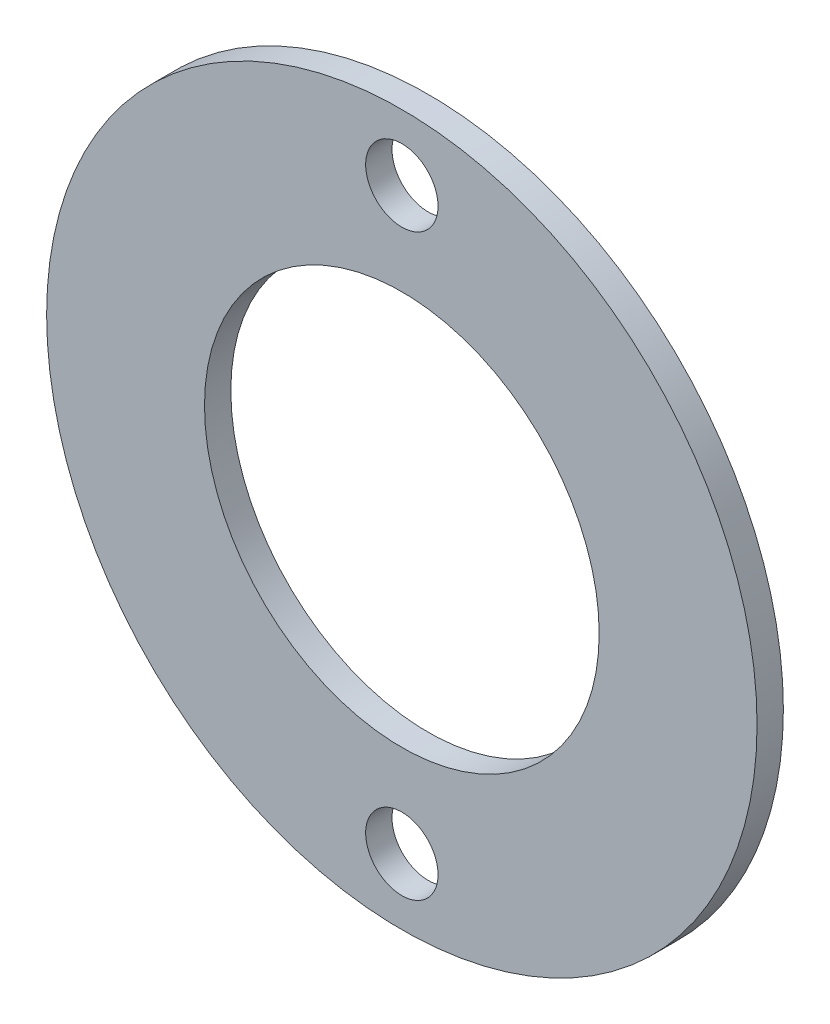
ISO-10303-21;
HEADER;
FILE_DESCRIPTION(('STEP AP214'),'2;1');
FILE_NAME('part.step','',(''),(''),'','','');
FILE_SCHEMA(('AUTOMOTIVE_DESIGN { 1 0 10303 214 1 1 1 1 }'));
ENDSEC;
DATA;
#1=APPLICATION_CONTEXT('core data for automotive mechanical design processes');
#2=APPLICATION_PROTOCOL_DEFINITION('international standard','automotive_design',2000,#1);
#3=PRODUCT_CONTEXT('',#1,'mechanical');
#4=PRODUCT('Part','Part','',(#3));
#5=PRODUCT_RELATED_PRODUCT_CATEGORY('part','',(#4));
#6=PRODUCT_DEFINITION_FORMATION('','',#4);
#7=PRODUCT_DEFINITION_CONTEXT('part definition',#1,'design');
#8=PRODUCT_DEFINITION('design','',#6,#7);
#9=PRODUCT_DEFINITION_SHAPE('','',#8);
#10=(LENGTH_UNIT() NAMED_UNIT(*) SI_UNIT(.MILLI.,.METRE.));
#11=(NAMED_UNIT(*) PLANE_ANGLE_UNIT() SI_UNIT($,.RADIAN.));
#12=(NAMED_UNIT(*) SI_UNIT($,.STERADIAN.) SOLID_ANGLE_UNIT());
#13=UNCERTAINTY_MEASURE_WITH_UNIT(LENGTH_MEASURE(1.E-05),#10,'distance_accuracy_value','');
#14=(GEOMETRIC_REPRESENTATION_CONTEXT(3) GLOBAL_UNCERTAINTY_ASSIGNED_CONTEXT((#13)) GLOBAL_UNIT_ASSIGNED_CONTEXT((#10,
#11,#12)) REPRESENTATION_CONTEXT('',''));
#15=CARTESIAN_POINT('',(0.,0.,0.));
#16=DIRECTION('',(0.,0.,1.));
#17=DIRECTION('',(1.,0.,0.));
#18=AXIS2_PLACEMENT_3D('',#15,#16,#17);
#19=CARTESIAN_POINT('',(0.,0.,1.99999999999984));
#20=DIRECTION('',(0.,0.,1.));
#21=DIRECTION('',(1.,0.,0.));
#22=AXIS2_PLACEMENT_3D('',#19,#20,#21);
#23=PLANE('',#22);
#24=CARTESIAN_POINT('',(0.,-22.,1.99999999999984));
#25=DIRECTION('',(0.,0.,1.));
#26=DIRECTION('',(1.,0.,0.));
#27=AXIS2_PLACEMENT_3D('',#24,#25,#26);
#28=CIRCLE('',#27,2.75);
#29=CARTESIAN_POINT('',(2.75000000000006,-22.,1.99999999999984));
#30=VERTEX_POINT('',#29);
#31=EDGE_CURVE('E56',#30,#30,#28,.T.);
#32=ORIENTED_EDGE('',*,*,#31,.F.);
#33=EDGE_LOOP('',(#32));
#34=FACE_BOUND('',#33,.T.);
#35=CARTESIAN_POINT('',(0.,0.,1.99999999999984));
#36=DIRECTION('',(0.,0.,1.));
#37=DIRECTION('',(1.,0.,0.));
#38=AXIS2_PLACEMENT_3D('',#35,#36,#37);
#39=CIRCLE('',#38,27.);
#40=CARTESIAN_POINT('',(27.0000000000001,0.,1.99999999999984));
#41=VERTEX_POINT('',#40);
#42=EDGE_CURVE('E10',#41,#41,#39,.T.);
#43=ORIENTED_EDGE('',*,*,#42,.T.);
#44=EDGE_LOOP('',(#43));
#45=FACE_BOUND('',#44,.T.);
#46=CARTESIAN_POINT('',(0.,22.,1.99999999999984));
#47=DIRECTION('',(0.,0.,1.));
#48=DIRECTION('',(1.,0.,0.));
#49=AXIS2_PLACEMENT_3D('',#46,#47,#48);
#50=CIRCLE('',#49,2.75);
#51=CARTESIAN_POINT('',(2.75000000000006,22.,1.99999999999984));
#52=VERTEX_POINT('',#51);
#53=EDGE_CURVE('E47',#52,#52,#50,.T.);
#54=ORIENTED_EDGE('',*,*,#53,.F.);
#55=EDGE_LOOP('',(#54));
#56=FACE_BOUND('',#55,.T.);
#57=CARTESIAN_POINT('',(0.,0.,1.99999999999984));
#58=DIRECTION('',(0.,0.,1.));
#59=DIRECTION('',(1.,0.,0.));
#60=AXIS2_PLACEMENT_3D('',#57,#58,#59);
#61=CIRCLE('',#60,15.);
#62=CARTESIAN_POINT('',(15.0000000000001,0.,1.99999999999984));
#63=VERTEX_POINT('',#62);
#64=EDGE_CURVE('E62',#63,#63,#61,.T.);
#65=ORIENTED_EDGE('',*,*,#64,.F.);
#66=EDGE_LOOP('',(#65));
#67=FACE_BOUND('',#66,.T.);
#68=ADVANCED_FACE('F36',(#34,#45,#56,#67),#23,.T.);
#69=CARTESIAN_POINT('',(0.,0.,-1.66533453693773E-13));
#70=DIRECTION('',(0.,0.,1.));
#71=DIRECTION('',(1.,0.,0.));
#72=AXIS2_PLACEMENT_3D('',#69,#70,#71);
#73=PLANE('',#72);
#74=CARTESIAN_POINT('',(0.,-22.,-2.22044604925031E-13));
#75=DIRECTION('',(0.,0.,1.));
#76=DIRECTION('',(1.,0.,0.));
#77=AXIS2_PLACEMENT_3D('',#74,#75,#76);
#78=CIRCLE('',#77,2.75);
#79=CARTESIAN_POINT('',(2.75000000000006,-22.,-2.22044604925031E-13));
#80=VERTEX_POINT('',#79);
#81=EDGE_CURVE('E59',#80,#80,#78,.T.);
#82=ORIENTED_EDGE('',*,*,#81,.T.);
#83=EDGE_LOOP('',(#82));
#84=FACE_BOUND('',#83,.T.);
#85=CARTESIAN_POINT('',(0.,0.,-1.66533453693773E-13));
#86=DIRECTION('',(0.,0.,1.));
#87=DIRECTION('',(1.,0.,0.));
#88=AXIS2_PLACEMENT_3D('',#85,#86,#87);
#89=CIRCLE('',#88,27.);
#90=CARTESIAN_POINT('',(27.0000000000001,0.,-1.66533453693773E-13));
#91=VERTEX_POINT('',#90);
#92=EDGE_CURVE('E43',#91,#91,#89,.T.);
#93=ORIENTED_EDGE('',*,*,#92,.F.);
#94=EDGE_LOOP('',(#93));
#95=FACE_BOUND('',#94,.T.);
#96=CARTESIAN_POINT('',(0.,22.,-1.66533453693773E-13));
#97=DIRECTION('',(0.,0.,1.));
#98=DIRECTION('',(1.,0.,0.));
#99=AXIS2_PLACEMENT_3D('',#96,#97,#98);
#100=CIRCLE('',#99,2.75);
#101=CARTESIAN_POINT('',(2.75000000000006,22.,-1.66533453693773E-13));
#102=VERTEX_POINT('',#101);
#103=EDGE_CURVE('E51',#102,#102,#100,.T.);
#104=ORIENTED_EDGE('',*,*,#103,.T.);
#105=EDGE_LOOP('',(#104));
#106=FACE_BOUND('',#105,.T.);
#107=CARTESIAN_POINT('',(0.,0.,-1.66533453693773E-13));
#108=DIRECTION('',(0.,0.,1.));
#109=DIRECTION('',(1.,0.,0.));
#110=AXIS2_PLACEMENT_3D('',#107,#108,#109);
#111=CIRCLE('',#110,15.);
#112=CARTESIAN_POINT('',(15.0000000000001,0.,-1.66533453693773E-13));
#113=VERTEX_POINT('',#112);
#114=EDGE_CURVE('E65',#113,#113,#111,.T.);
#115=ORIENTED_EDGE('',*,*,#114,.T.);
#116=EDGE_LOOP('',(#115));
#117=FACE_BOUND('',#116,.T.);
#118=ADVANCED_FACE('F69',(#84,#95,#106,#117),#73,.F.);
#119=CARTESIAN_POINT('',(0.,0.,1.99999999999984));
#120=DIRECTION('',(0.,0.,-1.));
#121=DIRECTION('',(-1.,0.,0.));
#122=AXIS2_PLACEMENT_3D('',#119,#120,#121);
#123=CYLINDRICAL_SURFACE('',#122,27.);
#124=ORIENTED_EDGE('',*,*,#42,.F.);
#125=EDGE_LOOP('',(#124));
#126=FACE_BOUND('',#125,.T.);
#127=ORIENTED_EDGE('',*,*,#92,.T.);
#128=EDGE_LOOP('',(#127));
#129=FACE_BOUND('',#128,.T.);
#130=ADVANCED_FACE('F38',(#126,#129),#123,.T.);
#131=CARTESIAN_POINT('',(0.,22.,1.99999999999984));
#132=DIRECTION('',(0.,0.,-1.));
#133=DIRECTION('',(-1.,0.,0.));
#134=AXIS2_PLACEMENT_3D('',#131,#132,#133);
#135=CYLINDRICAL_SURFACE('',#134,2.75);
#136=ORIENTED_EDGE('',*,*,#53,.T.);
#137=EDGE_LOOP('',(#136));
#138=FACE_BOUND('',#137,.T.);
#139=ORIENTED_EDGE('',*,*,#103,.F.);
#140=EDGE_LOOP('',(#139));
#141=FACE_BOUND('',#140,.T.);
#142=ADVANCED_FACE('F79',(#138,#141),#135,.F.);
#143=CARTESIAN_POINT('',(0.,-22.,1.99999999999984));
#144=DIRECTION('',(0.,0.,-1.));
#145=DIRECTION('',(-1.,0.,0.));
#146=AXIS2_PLACEMENT_3D('',#143,#144,#145);
#147=CYLINDRICAL_SURFACE('',#146,2.75);
#148=ORIENTED_EDGE('',*,*,#31,.T.);
#149=EDGE_LOOP('',(#148));
#150=FACE_BOUND('',#149,.T.);
#151=ORIENTED_EDGE('',*,*,#81,.F.);
#152=EDGE_LOOP('',(#151));
#153=FACE_BOUND('',#152,.T.);
#154=ADVANCED_FACE('F73',(#150,#153),#147,.F.);
#155=CARTESIAN_POINT('',(0.,0.,1.99999999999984));
#156=DIRECTION('',(0.,0.,-1.));
#157=DIRECTION('',(-1.,0.,0.));
#158=AXIS2_PLACEMENT_3D('',#155,#156,#157);
#159=CYLINDRICAL_SURFACE('',#158,15.);
#160=ORIENTED_EDGE('',*,*,#64,.T.);
#161=EDGE_LOOP('',(#160));
#162=FACE_BOUND('',#161,.T.);
#163=ORIENTED_EDGE('',*,*,#114,.F.);
#164=EDGE_LOOP('',(#163));
#165=FACE_BOUND('',#164,.T.);
#166=ADVANCED_FACE('F71',(#162,#165),#159,.F.);
#167=CLOSED_SHELL('',(#68,#118,#130,#142,#154,#166));
#168=MANIFOLD_SOLID_BREP('B2',#167);
#169=ADVANCED_BREP_SHAPE_REPRESENTATION('',(#18,#168),#14);
#170=SHAPE_DEFINITION_REPRESENTATION(#9,#169);
ENDSEC;
END-ISO-10303-21;
